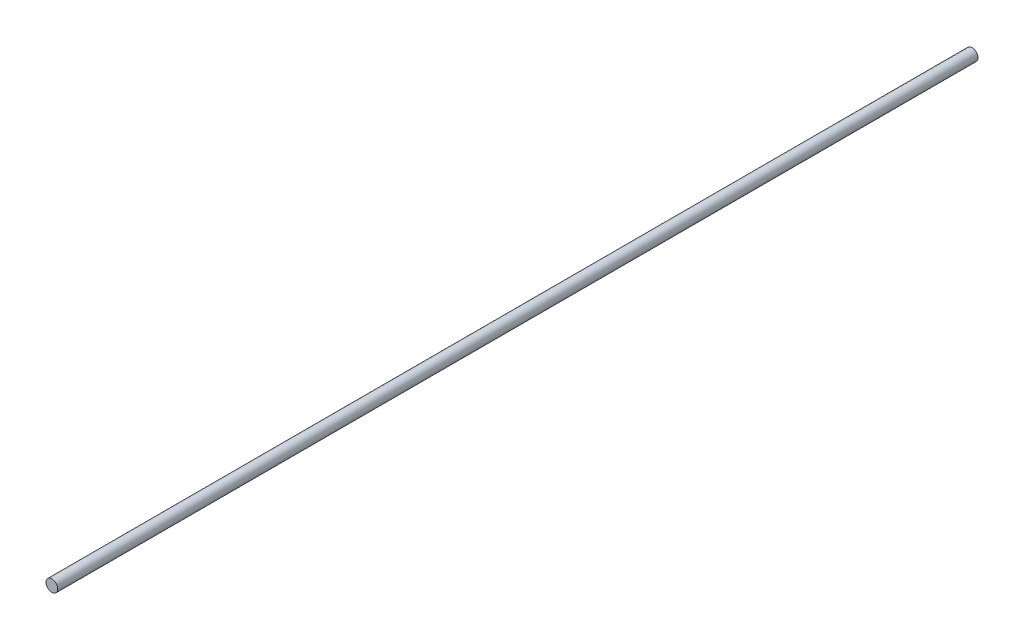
from build123d import *

# Parameters (mm, degrees)
SKETCH1_R           = 30
BOSS_EXTRUDE1_DEPTH = 4700


with BuildPart() as part:
    # Sketch1 → Boss-Extrude1 (new body)
    with BuildSketch(Plane.XY):
        Circle(SKETCH1_R)
    extrude(amount=-BOSS_EXTRUDE1_DEPTH)


solid = part.part
